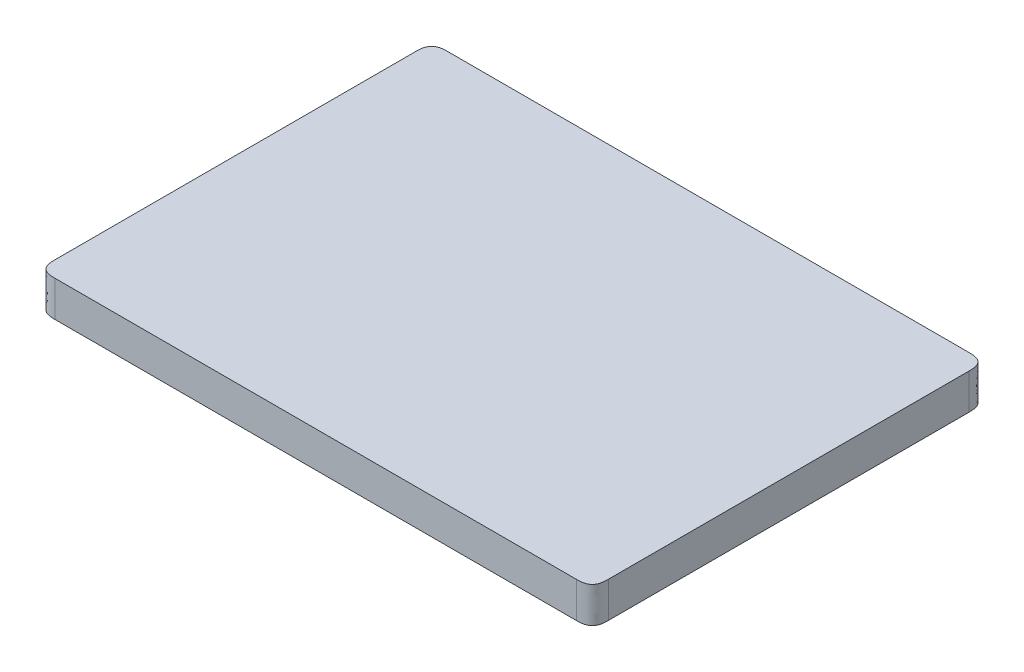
ISO-10303-21;
HEADER;
FILE_DESCRIPTION(('STEP AP214'),'2;1');
FILE_NAME('part.step','',(''),(''),'','','');
FILE_SCHEMA(('AUTOMOTIVE_DESIGN { 1 0 10303 214 1 1 1 1 }'));
ENDSEC;
DATA;
#1=APPLICATION_CONTEXT('core data for automotive mechanical design processes');
#2=APPLICATION_PROTOCOL_DEFINITION('international standard','automotive_design',2000,#1);
#3=PRODUCT_CONTEXT('',#1,'mechanical');
#4=PRODUCT('Part','Part','',(#3));
#5=PRODUCT_RELATED_PRODUCT_CATEGORY('part','',(#4));
#6=PRODUCT_DEFINITION_FORMATION('','',#4);
#7=PRODUCT_DEFINITION_CONTEXT('part definition',#1,'design');
#8=PRODUCT_DEFINITION('design','',#6,#7);
#9=PRODUCT_DEFINITION_SHAPE('','',#8);
#10=(LENGTH_UNIT() NAMED_UNIT(*) SI_UNIT(.MILLI.,.METRE.));
#11=(NAMED_UNIT(*) PLANE_ANGLE_UNIT() SI_UNIT($,.RADIAN.));
#12=(NAMED_UNIT(*) SI_UNIT($,.STERADIAN.) SOLID_ANGLE_UNIT());
#13=UNCERTAINTY_MEASURE_WITH_UNIT(LENGTH_MEASURE(1.E-05),#10,'distance_accuracy_value','');
#14=(GEOMETRIC_REPRESENTATION_CONTEXT(3) GLOBAL_UNCERTAINTY_ASSIGNED_CONTEXT((#13)) GLOBAL_UNIT_ASSIGNED_CONTEXT((#10,
#11,#12)) REPRESENTATION_CONTEXT('',''));
#15=CARTESIAN_POINT('',(0.,0.,0.));
#16=DIRECTION('',(0.,0.,1.));
#17=DIRECTION('',(1.,0.,0.));
#18=AXIS2_PLACEMENT_3D('',#15,#16,#17);
#19=CARTESIAN_POINT('',(155.,20.,110.));
#20=DIRECTION('',(-1.,0.,0.));
#21=DIRECTION('',(0.,0.,1.));
#22=AXIS2_PLACEMENT_3D('',#19,#20,#21);
#23=PLANE('',#22);
#24=DIRECTION('',(0.,0.,-1.));
#25=VECTOR('',#24,1.);
#26=CARTESIAN_POINT('',(155.,0.,110.));
#27=LINE('',#26,#25);
#28=CARTESIAN_POINT('',(155.,0.,101.));
#29=VERTEX_POINT('',#28);
#30=CARTESIAN_POINT('',(155.,0.,-101.));
#31=VERTEX_POINT('',#30);
#32=EDGE_CURVE('E150',#29,#31,#27,.T.);
#33=ORIENTED_EDGE('',*,*,#32,.T.);
#34=CARTESIAN_POINT('',(155.,21.,-101.));
#35=CARTESIAN_POINT('',(155.,13.6666666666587,-101.));
#36=CARTESIAN_POINT('',(155.,6.33333333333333,-101.));
#37=CARTESIAN_POINT('',(155.,-1.,-101.));
#38=B_SPLINE_CURVE_WITH_KNOTS('',3,(#34,#35,#36,#37),.UNSPECIFIED.,.F.,.F.,(4,4),(-0.001,0.021),.UNSPECIFIED.);
#39=CARTESIAN_POINT('',(155.,20.,-101.));
#40=VERTEX_POINT('',#39);
#41=EDGE_CURVE('E323',#31,#40,#38,.F.);
#42=ORIENTED_EDGE('',*,*,#41,.T.);
#43=DIRECTION('',(0.,0.,-1.));
#44=VECTOR('',#43,1.);
#45=CARTESIAN_POINT('',(155.,20.,110.));
#46=LINE('',#45,#44);
#47=CARTESIAN_POINT('',(155.,20.,101.));
#48=VERTEX_POINT('',#47);
#49=EDGE_CURVE('E148',#48,#40,#46,.T.);
#50=ORIENTED_EDGE('',*,*,#49,.F.);
#51=CARTESIAN_POINT('',(155.,-1.,101.));
#52=CARTESIAN_POINT('',(155.,6.33333333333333,101.));
#53=CARTESIAN_POINT('',(155.,13.6666666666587,101.));
#54=CARTESIAN_POINT('',(155.,21.,101.));
#55=B_SPLINE_CURVE_WITH_KNOTS('',3,(#51,#52,#53,#54),.UNSPECIFIED.,.F.,.F.,(4,4),(-0.001,0.021),.UNSPECIFIED.);
#56=EDGE_CURVE('E272',#48,#29,#55,.F.);
#57=ORIENTED_EDGE('',*,*,#56,.T.);
#58=EDGE_LOOP('',(#33,#42,#50,#57));
#59=FACE_BOUND('',#58,.T.);
#60=ADVANCED_FACE('F39',(#59),#23,.F.);
#61=CARTESIAN_POINT('',(-155.,20.,-110.));
#62=DIRECTION('',(0.,0.,1.));
#63=DIRECTION('',(1.,0.,0.));
#64=AXIS2_PLACEMENT_3D('',#61,#62,#63);
#65=PLANE('',#64);
#66=DIRECTION('',(-1.,0.,0.));
#67=VECTOR('',#66,1.);
#68=CARTESIAN_POINT('',(-155.,0.,-110.));
#69=LINE('',#68,#67);
#70=CARTESIAN_POINT('',(146.,0.,-110.));
#71=VERTEX_POINT('',#70);
#72=CARTESIAN_POINT('',(-146.,0.,-110.));
#73=VERTEX_POINT('',#72);
#74=EDGE_CURVE('E146',#71,#73,#69,.T.);
#75=ORIENTED_EDGE('',*,*,#74,.T.);
#76=CARTESIAN_POINT('',(-146.,21.,-110.));
#77=CARTESIAN_POINT('',(-146.,13.6666666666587,-110.));
#78=CARTESIAN_POINT('',(-146.,6.33333333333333,-110.));
#79=CARTESIAN_POINT('',(-146.,-1.,-110.));
#80=B_SPLINE_CURVE_WITH_KNOTS('',3,(#76,#77,#78,#79),.UNSPECIFIED.,.F.,.F.,(4,4),(-0.001,0.021),.UNSPECIFIED.);
#81=CARTESIAN_POINT('',(-146.,20.,-110.));
#82=VERTEX_POINT('',#81);
#83=EDGE_CURVE('E119',#73,#82,#80,.F.);
#84=ORIENTED_EDGE('',*,*,#83,.T.);
#85=DIRECTION('',(-1.,0.,0.));
#86=VECTOR('',#85,1.);
#87=CARTESIAN_POINT('',(-155.,20.,-110.));
#88=LINE('',#87,#86);
#89=CARTESIAN_POINT('',(146.,20.,-110.));
#90=VERTEX_POINT('',#89);
#91=EDGE_CURVE('E203',#90,#82,#88,.T.);
#92=ORIENTED_EDGE('',*,*,#91,.F.);
#93=CARTESIAN_POINT('',(146.,-1.,-110.));
#94=CARTESIAN_POINT('',(146.,6.33333333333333,-110.));
#95=CARTESIAN_POINT('',(146.,13.6666666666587,-110.));
#96=CARTESIAN_POINT('',(146.,21.,-110.));
#97=B_SPLINE_CURVE_WITH_KNOTS('',3,(#93,#94,#95,#96),.UNSPECIFIED.,.F.,.F.,(4,4),(-0.001,0.021),.UNSPECIFIED.);
#98=EDGE_CURVE('E126',#90,#71,#97,.F.);
#99=ORIENTED_EDGE('',*,*,#98,.T.);
#100=EDGE_LOOP('',(#75,#84,#92,#99));
#101=FACE_BOUND('',#100,.T.);
#102=ADVANCED_FACE('F288',(#101),#65,.F.);
#103=CARTESIAN_POINT('',(-155.,20.,110.));
#104=DIRECTION('',(1.,0.,0.));
#105=DIRECTION('',(0.,0.,-1.));
#106=AXIS2_PLACEMENT_3D('',#103,#104,#105);
#107=PLANE('',#106);
#108=DIRECTION('',(0.,0.,1.));
#109=VECTOR('',#108,1.);
#110=CARTESIAN_POINT('',(-155.,20.,110.));
#111=LINE('',#110,#109);
#112=CARTESIAN_POINT('',(-155.,20.,-101.));
#113=VERTEX_POINT('',#112);
#114=CARTESIAN_POINT('',(-155.,20.,101.));
#115=VERTEX_POINT('',#114);
#116=EDGE_CURVE('E137',#113,#115,#111,.T.);
#117=ORIENTED_EDGE('',*,*,#116,.F.);
#118=CARTESIAN_POINT('',(-155.,-1.,-101.));
#119=CARTESIAN_POINT('',(-155.,6.33333333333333,-101.));
#120=CARTESIAN_POINT('',(-155.,13.6666666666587,-101.));
#121=CARTESIAN_POINT('',(-155.,21.,-101.));
#122=B_SPLINE_CURVE_WITH_KNOTS('',3,(#118,#119,#120,#121),.UNSPECIFIED.,.F.,.F.,(4,4),(-0.001,
0.021),.UNSPECIFIED.);
#123=CARTESIAN_POINT('',(-155.,0.,-101.));
#124=VERTEX_POINT('',#123);
#125=EDGE_CURVE('E117',#113,#124,#122,.F.);
#126=ORIENTED_EDGE('',*,*,#125,.T.);
#127=DIRECTION('',(0.,0.,1.));
#128=VECTOR('',#127,1.);
#129=CARTESIAN_POINT('',(-155.,0.,110.));
#130=LINE('',#129,#128);
#131=CARTESIAN_POINT('',(-155.,0.,101.));
#132=VERTEX_POINT('',#131);
#133=EDGE_CURVE('E135',#124,#132,#130,.T.);
#134=ORIENTED_EDGE('',*,*,#133,.T.);
#135=CARTESIAN_POINT('',(-155.,21.,101.));
#136=CARTESIAN_POINT('',(-155.,13.6666666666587,101.));
#137=CARTESIAN_POINT('',(-155.,6.33333333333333,101.));
#138=CARTESIAN_POINT('',(-155.,-1.,101.));
#139=B_SPLINE_CURVE_WITH_KNOTS('',3,(#135,#136,#137,#138),.UNSPECIFIED.,.F.,.F.,(4,4),(-0.001,
0.021),.UNSPECIFIED.);
#140=EDGE_CURVE('E139',#132,#115,#139,.F.);
#141=ORIENTED_EDGE('',*,*,#140,.T.);
#142=EDGE_LOOP('',(#117,#126,#134,#141));
#143=FACE_BOUND('',#142,.T.);
#144=ADVANCED_FACE('F134',(#143),#107,.F.);
#145=CARTESIAN_POINT('',(-155.,20.,110.));
#146=DIRECTION('',(0.,0.,-1.));
#147=DIRECTION('',(-1.,0.,0.));
#148=AXIS2_PLACEMENT_3D('',#145,#146,#147);
#149=PLANE('',#148);
#150=DIRECTION('',(1.,0.,0.));
#151=VECTOR('',#150,1.);
#152=CARTESIAN_POINT('',(-155.,0.,110.));
#153=LINE('',#152,#151);
#154=CARTESIAN_POINT('',(-146.,0.,110.));
#155=VERTEX_POINT('',#154);
#156=CARTESIAN_POINT('',(146.,0.,110.));
#157=VERTEX_POINT('',#156);
#158=EDGE_CURVE('E145',#155,#157,#153,.T.);
#159=ORIENTED_EDGE('',*,*,#158,.T.);
#160=CARTESIAN_POINT('',(146.,21.,110.));
#161=CARTESIAN_POINT('',(146.,13.6666666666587,110.));
#162=CARTESIAN_POINT('',(146.,6.33333333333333,110.));
#163=CARTESIAN_POINT('',(146.,-1.,110.));
#164=B_SPLINE_CURVE_WITH_KNOTS('',3,(#160,#161,#162,#163),.UNSPECIFIED.,.F.,.F.,(4,4),(-0.001,
0.021),.UNSPECIFIED.);
#165=CARTESIAN_POINT('',(146.,20.,110.));
#166=VERTEX_POINT('',#165);
#167=EDGE_CURVE('E11',#157,#166,#164,.F.);
#168=ORIENTED_EDGE('',*,*,#167,.T.);
#169=DIRECTION('',(1.,0.,0.));
#170=VECTOR('',#169,1.);
#171=CARTESIAN_POINT('',(-155.,20.,110.));
#172=LINE('',#171,#170);
#173=CARTESIAN_POINT('',(-146.,20.,110.));
#174=VERTEX_POINT('',#173);
#175=EDGE_CURVE('E220',#174,#166,#172,.T.);
#176=ORIENTED_EDGE('',*,*,#175,.F.);
#177=CARTESIAN_POINT('',(-146.,-1.,110.));
#178=CARTESIAN_POINT('',(-146.,6.33333333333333,110.));
#179=CARTESIAN_POINT('',(-146.,13.6666666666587,110.));
#180=CARTESIAN_POINT('',(-146.,21.,110.));
#181=B_SPLINE_CURVE_WITH_KNOTS('',3,(#177,#178,#179,#180),.UNSPECIFIED.,.F.,.F.,(4,4),(-0.001,
0.021),.UNSPECIFIED.);
#182=EDGE_CURVE('E53',#174,#155,#181,.F.);
#183=ORIENTED_EDGE('',*,*,#182,.T.);
#184=EDGE_LOOP('',(#159,#168,#176,#183));
#185=FACE_BOUND('',#184,.T.);
#186=ADVANCED_FACE('F182',(#185),#149,.F.);
#187=CARTESIAN_POINT('',(0.,20.,0.));
#188=DIRECTION('',(0.,-1.,0.));
#189=DIRECTION('',(0.,0.,-1.));
#190=AXIS2_PLACEMENT_3D('',#187,#188,#189);
#191=PLANE('',#190);
#192=ORIENTED_EDGE('',*,*,#91,.T.);
#193=CARTESIAN_POINT('',(-155.,20.,-101.));
#194=CARTESIAN_POINT('',(-155.,20.,-102.513782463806));
#195=CARTESIAN_POINT('',(-155.,20.,-104.027564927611));
#196=CARTESIAN_POINT('',(-154.354772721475,20.,-107.363961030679));
#197=CARTESIAN_POINT('',(-152.363961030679,20.,-109.354772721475));
#198=CARTESIAN_POINT('',(-149.027564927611,20.,-110.));
#199=CARTESIAN_POINT('',(-147.513782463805,20.,-110.));
#200=CARTESIAN_POINT('',(-146.,20.,-110.));
#201=B_SPLINE_CURVE_WITH_KNOTS('',5,(#193,#194,#195,#196,#197,#198,#199,#200),.UNSPECIFIED.,.F.,
.F.,(6,2,6),(0.,0.5,1.),.UNSPECIFIED.);
#202=EDGE_CURVE('E258',#82,#113,#201,.F.);
#203=ORIENTED_EDGE('',*,*,#202,.T.);
#204=ORIENTED_EDGE('',*,*,#116,.T.);
#205=CARTESIAN_POINT('',(-146.,20.,110.));
#206=CARTESIAN_POINT('',(-147.513782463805,20.,110.));
#207=CARTESIAN_POINT('',(-149.027564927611,20.,110.));
#208=CARTESIAN_POINT('',(-152.363961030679,20.,109.354772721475));
#209=CARTESIAN_POINT('',(-154.354772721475,20.,107.363961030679));
#210=CARTESIAN_POINT('',(-155.,20.,104.027564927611));
#211=CARTESIAN_POINT('',(-155.,20.,102.513782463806));
#212=CARTESIAN_POINT('',(-155.,20.,101.));
#213=B_SPLINE_CURVE_WITH_KNOTS('',5,(#205,#206,#207,#208,#209,#210,#211,#212),.UNSPECIFIED.,.F.,
.F.,(6,2,6),(0.,0.5,1.),.UNSPECIFIED.);
#214=EDGE_CURVE('E66',#115,#174,#213,.F.);
#215=ORIENTED_EDGE('',*,*,#214,.T.);
#216=ORIENTED_EDGE('',*,*,#175,.T.);
#217=CARTESIAN_POINT('',(155.,20.,101.));
#218=CARTESIAN_POINT('',(155.,20.,102.513782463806));
#219=CARTESIAN_POINT('',(155.,20.,104.027564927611));
#220=CARTESIAN_POINT('',(154.354772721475,20.,107.363961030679));
#221=CARTESIAN_POINT('',(152.363961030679,20.,109.354772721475));
#222=CARTESIAN_POINT('',(149.027564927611,20.,110.));
#223=CARTESIAN_POINT('',(147.513782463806,20.,110.));
#224=CARTESIAN_POINT('',(146.,20.,110.));
#225=B_SPLINE_CURVE_WITH_KNOTS('',5,(#217,#218,#219,#220,#221,#222,#223,#224),.UNSPECIFIED.,.F.,
.F.,(6,2,6),(0.,0.5,1.),.UNSPECIFIED.);
#226=EDGE_CURVE('E235',#166,#48,#225,.F.);
#227=ORIENTED_EDGE('',*,*,#226,.T.);
#228=ORIENTED_EDGE('',*,*,#49,.T.);
#229=CARTESIAN_POINT('',(146.,20.,-110.));
#230=CARTESIAN_POINT('',(147.513782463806,20.,-110.));
#231=CARTESIAN_POINT('',(149.027564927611,20.,-110.));
#232=CARTESIAN_POINT('',(152.363961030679,20.,-109.354772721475));
#233=CARTESIAN_POINT('',(154.354772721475,20.,-107.363961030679));
#234=CARTESIAN_POINT('',(155.,20.,-104.027564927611));
#235=CARTESIAN_POINT('',(155.,20.,-102.513782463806));
#236=CARTESIAN_POINT('',(155.,20.,-101.));
#237=B_SPLINE_CURVE_WITH_KNOTS('',5,(#229,#230,#231,#232,#233,#234,#235,#236),.UNSPECIFIED.,.F.,
.F.,(6,2,6),(0.,0.5,1.),.UNSPECIFIED.);
#238=EDGE_CURVE('E247',#40,#90,#237,.F.);
#239=ORIENTED_EDGE('',*,*,#238,.T.);
#240=EDGE_LOOP('',(#192,#203,#204,#215,#216,#227,#228,#239));
#241=FACE_BOUND('',#240,.T.);
#242=ADVANCED_FACE('F180',(#241),#191,.F.);
#243=CARTESIAN_POINT('',(0.,0.,0.));
#244=DIRECTION('',(0.,-1.,0.));
#245=DIRECTION('',(0.,0.,-1.));
#246=AXIS2_PLACEMENT_3D('',#243,#244,#245);
#247=PLANE('',#246);
#248=ORIENTED_EDGE('',*,*,#133,.F.);
#249=CARTESIAN_POINT('',(-146.,0.,-110.));
#250=CARTESIAN_POINT('',(-147.513782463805,0.,-110.));
#251=CARTESIAN_POINT('',(-149.027564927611,0.,-110.));
#252=CARTESIAN_POINT('',(-152.363961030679,0.,-109.354772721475));
#253=CARTESIAN_POINT('',(-154.354772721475,0.,-107.363961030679));
#254=CARTESIAN_POINT('',(-155.,0.,-104.027564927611));
#255=CARTESIAN_POINT('',(-155.,0.,-102.513782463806));
#256=CARTESIAN_POINT('',(-155.,0.,-101.));
#257=B_SPLINE_CURVE_WITH_KNOTS('',5,(#249,#250,#251,#252,#253,#254,#255,#256),.UNSPECIFIED.,.F.,
.F.,(6,2,6),(0.,0.5,1.),.UNSPECIFIED.);
#258=EDGE_CURVE('E112',#124,#73,#257,.F.);
#259=ORIENTED_EDGE('',*,*,#258,.T.);
#260=ORIENTED_EDGE('',*,*,#74,.F.);
#261=CARTESIAN_POINT('',(155.,0.,-101.));
#262=CARTESIAN_POINT('',(155.,0.,-102.513782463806));
#263=CARTESIAN_POINT('',(155.,0.,-104.027564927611));
#264=CARTESIAN_POINT('',(154.354772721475,0.,-107.363961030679));
#265=CARTESIAN_POINT('',(152.363961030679,0.,-109.354772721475));
#266=CARTESIAN_POINT('',(149.027564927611,0.,-110.));
#267=CARTESIAN_POINT('',(147.513782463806,0.,-110.));
#268=CARTESIAN_POINT('',(146.,0.,-110.));
#269=B_SPLINE_CURVE_WITH_KNOTS('',5,(#261,#262,#263,#264,#265,#266,#267,#268),.UNSPECIFIED.,.F.,
.F.,(6,2,6),(0.,0.5,1.),.UNSPECIFIED.);
#270=EDGE_CURVE('E127',#71,#31,#269,.F.);
#271=ORIENTED_EDGE('',*,*,#270,.T.);
#272=ORIENTED_EDGE('',*,*,#32,.F.);
#273=CARTESIAN_POINT('',(146.,0.,110.));
#274=CARTESIAN_POINT('',(147.513782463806,0.,110.));
#275=CARTESIAN_POINT('',(149.027564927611,0.,110.));
#276=CARTESIAN_POINT('',(152.363961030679,0.,109.354772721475));
#277=CARTESIAN_POINT('',(154.354772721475,0.,107.363961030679));
#278=CARTESIAN_POINT('',(155.,0.,104.027564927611));
#279=CARTESIAN_POINT('',(155.,0.,102.513782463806));
#280=CARTESIAN_POINT('',(155.,0.,101.));
#281=B_SPLINE_CURVE_WITH_KNOTS('',5,(#273,#274,#275,#276,#277,#278,#279,#280),.UNSPECIFIED.,.F.,
.F.,(6,2,6),(0.,0.5,1.),.UNSPECIFIED.);
#282=EDGE_CURVE('E324',#29,#157,#281,.F.);
#283=ORIENTED_EDGE('',*,*,#282,.T.);
#284=ORIENTED_EDGE('',*,*,#158,.F.);
#285=CARTESIAN_POINT('',(-155.,0.,101.));
#286=CARTESIAN_POINT('',(-155.,0.,102.513782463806));
#287=CARTESIAN_POINT('',(-155.,0.,104.027564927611));
#288=CARTESIAN_POINT('',(-154.354772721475,0.,107.363961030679));
#289=CARTESIAN_POINT('',(-152.363961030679,0.,109.354772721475));
#290=CARTESIAN_POINT('',(-149.027564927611,0.,110.));
#291=CARTESIAN_POINT('',(-147.513782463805,0.,110.));
#292=CARTESIAN_POINT('',(-146.,0.,110.));
#293=B_SPLINE_CURVE_WITH_KNOTS('',5,(#285,#286,#287,#288,#289,#290,#291,#292),.UNSPECIFIED.,.F.,
.F.,(6,2,6),(0.,0.5,1.),.UNSPECIFIED.);
#294=EDGE_CURVE('E138',#155,#132,#293,.F.);
#295=ORIENTED_EDGE('',*,*,#294,.T.);
#296=EDGE_LOOP('',(#248,#259,#260,#271,#272,#283,#284,#295));
#297=FACE_BOUND('',#296,.T.);
#298=ADVANCED_FACE('F142',(#297),#247,.T.);
#299=CARTESIAN_POINT('',(-155.,21.,-101.));
#300=CARTESIAN_POINT('',(-155.,13.6666666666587,-101.));
#301=CARTESIAN_POINT('',(-155.,6.33333333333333,-101.));
#302=CARTESIAN_POINT('',(-155.,-1.,-101.));
#303=CARTESIAN_POINT('',(-155.,21.,-102.513782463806));
#304=CARTESIAN_POINT('',(-155.,13.6666666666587,-102.513782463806));
#305=CARTESIAN_POINT('',(-155.,6.33333333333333,-102.513782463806));
#306=CARTESIAN_POINT('',(-155.,-1.,-102.513782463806));
#307=CARTESIAN_POINT('',(-155.,21.,-104.027564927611));
#308=CARTESIAN_POINT('',(-155.,13.6666666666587,-104.027564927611));
#309=CARTESIAN_POINT('',(-155.,6.33333333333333,-104.027564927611));
#310=CARTESIAN_POINT('',(-155.,-1.,-104.027564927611));
#311=CARTESIAN_POINT('',(-154.354772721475,21.,-107.363961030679));
#312=CARTESIAN_POINT('',(-154.354772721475,13.6666666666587,-107.363961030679));
#313=CARTESIAN_POINT('',(-154.354772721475,6.33333333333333,-107.363961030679));
#314=CARTESIAN_POINT('',(-154.354772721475,-1.,-107.363961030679));
#315=CARTESIAN_POINT('',(-152.363961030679,21.,-109.354772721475));
#316=CARTESIAN_POINT('',(-152.363961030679,13.6666666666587,-109.354772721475));
#317=CARTESIAN_POINT('',(-152.363961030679,6.33333333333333,-109.354772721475));
#318=CARTESIAN_POINT('',(-152.363961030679,-1.,-109.354772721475));
#319=CARTESIAN_POINT('',(-149.027564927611,21.,-110.));
#320=CARTESIAN_POINT('',(-149.027564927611,13.6666666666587,-110.));
#321=CARTESIAN_POINT('',(-149.027564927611,6.33333333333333,-110.));
#322=CARTESIAN_POINT('',(-149.027564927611,-1.,-110.));
#323=CARTESIAN_POINT('',(-147.513782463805,21.,-110.));
#324=CARTESIAN_POINT('',(-147.513782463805,13.6666666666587,-110.));
#325=CARTESIAN_POINT('',(-147.513782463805,6.33333333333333,-110.));
#326=CARTESIAN_POINT('',(-147.513782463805,-1.,-110.));
#327=CARTESIAN_POINT('',(-146.,21.,-110.));
#328=CARTESIAN_POINT('',(-146.,13.6666666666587,-110.));
#329=CARTESIAN_POINT('',(-146.,6.33333333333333,-110.));
#330=CARTESIAN_POINT('',(-146.,-1.,-110.));
#331=B_SPLINE_SURFACE_WITH_KNOTS('',5,3,((#299,#300,#301,#302),(#303,#304,#305,#306),(#307,#308,
#309,#310),(#311,#312,#313,#314),(#315,#316,#317,#318),(#319,#320,#321,#322),(#323,#324,#325,
#326),(#327,#328,#329,#330)),.UNSPECIFIED.,.F.,.F.,.F.,(6,2,6),(4,4),(0.,0.5,1.),(-0.001,0.021),.UNSPECIFIED.);
#332=ORIENTED_EDGE('',*,*,#202,.F.);
#333=ORIENTED_EDGE('',*,*,#83,.F.);
#334=ORIENTED_EDGE('',*,*,#258,.F.);
#335=ORIENTED_EDGE('',*,*,#125,.F.);
#336=EDGE_LOOP('',(#332,#333,#334,#335));
#337=FACE_BOUND('',#336,.T.);
#338=ADVANCED_FACE('F116',(#337),#331,.T.);
#339=CARTESIAN_POINT('',(146.,21.,-110.));
#340=CARTESIAN_POINT('',(146.,13.6666666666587,-110.));
#341=CARTESIAN_POINT('',(146.,6.33333333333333,-110.));
#342=CARTESIAN_POINT('',(146.,-1.,-110.));
#343=CARTESIAN_POINT('',(147.513782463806,21.,-110.));
#344=CARTESIAN_POINT('',(147.513782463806,13.6666666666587,-110.));
#345=CARTESIAN_POINT('',(147.513782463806,6.33333333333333,-110.));
#346=CARTESIAN_POINT('',(147.513782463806,-1.,-110.));
#347=CARTESIAN_POINT('',(149.027564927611,21.,-110.));
#348=CARTESIAN_POINT('',(149.027564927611,13.6666666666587,-110.));
#349=CARTESIAN_POINT('',(149.027564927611,6.33333333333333,-110.));
#350=CARTESIAN_POINT('',(149.027564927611,-1.,-110.));
#351=CARTESIAN_POINT('',(152.363961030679,21.,-109.354772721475));
#352=CARTESIAN_POINT('',(152.363961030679,13.6666666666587,-109.354772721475));
#353=CARTESIAN_POINT('',(152.363961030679,6.33333333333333,-109.354772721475));
#354=CARTESIAN_POINT('',(152.363961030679,-1.,-109.354772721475));
#355=CARTESIAN_POINT('',(154.354772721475,21.,-107.363961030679));
#356=CARTESIAN_POINT('',(154.354772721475,13.6666666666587,-107.363961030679));
#357=CARTESIAN_POINT('',(154.354772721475,6.33333333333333,-107.363961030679));
#358=CARTESIAN_POINT('',(154.354772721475,-1.,-107.363961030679));
#359=CARTESIAN_POINT('',(155.,21.,-104.027564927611));
#360=CARTESIAN_POINT('',(155.,13.6666666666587,-104.027564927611));
#361=CARTESIAN_POINT('',(155.,6.33333333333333,-104.027564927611));
#362=CARTESIAN_POINT('',(155.,-1.,-104.027564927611));
#363=CARTESIAN_POINT('',(155.,21.,-102.513782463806));
#364=CARTESIAN_POINT('',(155.,13.6666666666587,-102.513782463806));
#365=CARTESIAN_POINT('',(155.,6.33333333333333,-102.513782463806));
#366=CARTESIAN_POINT('',(155.,-1.,-102.513782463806));
#367=CARTESIAN_POINT('',(155.,21.,-101.));
#368=CARTESIAN_POINT('',(155.,13.6666666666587,-101.));
#369=CARTESIAN_POINT('',(155.,6.33333333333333,-101.));
#370=CARTESIAN_POINT('',(155.,-1.,-101.));
#371=B_SPLINE_SURFACE_WITH_KNOTS('',5,3,((#339,#340,#341,#342),(#343,#344,#345,#346),(#347,#348,
#349,#350),(#351,#352,#353,#354),(#355,#356,#357,#358),(#359,#360,#361,#362),(#363,#364,#365,
#366),(#367,#368,#369,#370)),.UNSPECIFIED.,.F.,.F.,.F.,(6,2,6),(4,4),(0.,0.5,1.),(-0.001,0.021),.UNSPECIFIED.);
#372=ORIENTED_EDGE('',*,*,#238,.F.);
#373=ORIENTED_EDGE('',*,*,#41,.F.);
#374=ORIENTED_EDGE('',*,*,#270,.F.);
#375=ORIENTED_EDGE('',*,*,#98,.F.);
#376=EDGE_LOOP('',(#372,#373,#374,#375));
#377=FACE_BOUND('',#376,.T.);
#378=ADVANCED_FACE('F332',(#377),#371,.T.);
#379=CARTESIAN_POINT('',(155.,21.,101.));
#380=CARTESIAN_POINT('',(155.,13.6666666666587,101.));
#381=CARTESIAN_POINT('',(155.,6.33333333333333,101.));
#382=CARTESIAN_POINT('',(155.,-1.,101.));
#383=CARTESIAN_POINT('',(155.,21.,102.513782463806));
#384=CARTESIAN_POINT('',(155.,13.6666666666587,102.513782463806));
#385=CARTESIAN_POINT('',(155.,6.33333333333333,102.513782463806));
#386=CARTESIAN_POINT('',(155.,-1.,102.513782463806));
#387=CARTESIAN_POINT('',(155.,21.,104.027564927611));
#388=CARTESIAN_POINT('',(155.,13.6666666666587,104.027564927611));
#389=CARTESIAN_POINT('',(155.,6.33333333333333,104.027564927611));
#390=CARTESIAN_POINT('',(155.,-1.,104.027564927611));
#391=CARTESIAN_POINT('',(154.354772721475,21.,107.363961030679));
#392=CARTESIAN_POINT('',(154.354772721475,13.6666666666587,107.363961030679));
#393=CARTESIAN_POINT('',(154.354772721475,6.33333333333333,107.363961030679));
#394=CARTESIAN_POINT('',(154.354772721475,-1.,107.363961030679));
#395=CARTESIAN_POINT('',(152.363961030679,21.,109.354772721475));
#396=CARTESIAN_POINT('',(152.363961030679,13.6666666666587,109.354772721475));
#397=CARTESIAN_POINT('',(152.363961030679,6.33333333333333,109.354772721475));
#398=CARTESIAN_POINT('',(152.363961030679,-1.,109.354772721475));
#399=CARTESIAN_POINT('',(149.027564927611,21.,110.));
#400=CARTESIAN_POINT('',(149.027564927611,13.6666666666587,110.));
#401=CARTESIAN_POINT('',(149.027564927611,6.33333333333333,110.));
#402=CARTESIAN_POINT('',(149.027564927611,-1.,110.));
#403=CARTESIAN_POINT('',(147.513782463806,21.,110.));
#404=CARTESIAN_POINT('',(147.513782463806,13.6666666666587,110.));
#405=CARTESIAN_POINT('',(147.513782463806,6.33333333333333,110.));
#406=CARTESIAN_POINT('',(147.513782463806,-1.,110.));
#407=CARTESIAN_POINT('',(146.,21.,110.));
#408=CARTESIAN_POINT('',(146.,13.6666666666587,110.));
#409=CARTESIAN_POINT('',(146.,6.33333333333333,110.));
#410=CARTESIAN_POINT('',(146.,-1.,110.));
#411=B_SPLINE_SURFACE_WITH_KNOTS('',5,3,((#379,#380,#381,#382),(#383,#384,#385,#386),(#387,#388,
#389,#390),(#391,#392,#393,#394),(#395,#396,#397,#398),(#399,#400,#401,#402),(#403,#404,#405,
#406),(#407,#408,#409,#410)),.UNSPECIFIED.,.F.,.F.,.F.,(6,2,6),(4,4),(0.,0.5,1.),(-0.001,0.021),.UNSPECIFIED.);
#412=ORIENTED_EDGE('',*,*,#226,.F.);
#413=ORIENTED_EDGE('',*,*,#167,.F.);
#414=ORIENTED_EDGE('',*,*,#282,.F.);
#415=ORIENTED_EDGE('',*,*,#56,.F.);
#416=EDGE_LOOP('',(#412,#413,#414,#415));
#417=FACE_BOUND('',#416,.T.);
#418=ADVANCED_FACE('F354',(#417),#411,.T.);
#419=CARTESIAN_POINT('',(-146.,21.,110.));
#420=CARTESIAN_POINT('',(-146.,13.6666666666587,110.));
#421=CARTESIAN_POINT('',(-146.,6.33333333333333,110.));
#422=CARTESIAN_POINT('',(-146.,-1.,110.));
#423=CARTESIAN_POINT('',(-147.513782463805,21.,110.));
#424=CARTESIAN_POINT('',(-147.513782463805,13.6666666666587,110.));
#425=CARTESIAN_POINT('',(-147.513782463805,6.33333333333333,110.));
#426=CARTESIAN_POINT('',(-147.513782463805,-1.,110.));
#427=CARTESIAN_POINT('',(-149.027564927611,21.,110.));
#428=CARTESIAN_POINT('',(-149.027564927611,13.6666666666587,110.));
#429=CARTESIAN_POINT('',(-149.027564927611,6.33333333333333,110.));
#430=CARTESIAN_POINT('',(-149.027564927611,-1.,110.));
#431=CARTESIAN_POINT('',(-152.363961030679,21.,109.354772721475));
#432=CARTESIAN_POINT('',(-152.363961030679,13.6666666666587,109.354772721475));
#433=CARTESIAN_POINT('',(-152.363961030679,6.33333333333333,109.354772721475));
#434=CARTESIAN_POINT('',(-152.363961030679,-1.,109.354772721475));
#435=CARTESIAN_POINT('',(-154.354772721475,21.,107.363961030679));
#436=CARTESIAN_POINT('',(-154.354772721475,13.6666666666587,107.363961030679));
#437=CARTESIAN_POINT('',(-154.354772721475,6.33333333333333,107.363961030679));
#438=CARTESIAN_POINT('',(-154.354772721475,-1.,107.363961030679));
#439=CARTESIAN_POINT('',(-155.,21.,104.027564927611));
#440=CARTESIAN_POINT('',(-155.,13.6666666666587,104.027564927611));
#441=CARTESIAN_POINT('',(-155.,6.33333333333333,104.027564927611));
#442=CARTESIAN_POINT('',(-155.,-1.,104.027564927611));
#443=CARTESIAN_POINT('',(-155.,21.,102.513782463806));
#444=CARTESIAN_POINT('',(-155.,13.6666666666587,102.513782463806));
#445=CARTESIAN_POINT('',(-155.,6.33333333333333,102.513782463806));
#446=CARTESIAN_POINT('',(-155.,-1.,102.513782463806));
#447=CARTESIAN_POINT('',(-155.,21.,101.));
#448=CARTESIAN_POINT('',(-155.,13.6666666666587,101.));
#449=CARTESIAN_POINT('',(-155.,6.33333333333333,101.));
#450=CARTESIAN_POINT('',(-155.,-1.,101.));
#451=B_SPLINE_SURFACE_WITH_KNOTS('',5,3,((#419,#420,#421,#422),(#423,#424,#425,#426),(#427,#428,
#429,#430),(#431,#432,#433,#434),(#435,#436,#437,#438),(#439,#440,#441,#442),(#443,#444,#445,
#446),(#447,#448,#449,#450)),.UNSPECIFIED.,.F.,.F.,.F.,(6,2,6),(4,4),(0.,0.5,1.),(-0.001,0.021),.UNSPECIFIED.);
#452=ORIENTED_EDGE('',*,*,#214,.F.);
#453=ORIENTED_EDGE('',*,*,#140,.F.);
#454=ORIENTED_EDGE('',*,*,#294,.F.);
#455=ORIENTED_EDGE('',*,*,#182,.F.);
#456=EDGE_LOOP('',(#452,#453,#454,#455));
#457=FACE_BOUND('',#456,.T.);
#458=ADVANCED_FACE('F42',(#457),#451,.T.);
#459=CLOSED_SHELL('',(#60,#102,#144,#186,#242,#298,#338,#378,#418,#458));
#460=MANIFOLD_SOLID_BREP('B2',#459);
#461=ADVANCED_BREP_SHAPE_REPRESENTATION('',(#18,#460),#14);
#462=SHAPE_DEFINITION_REPRESENTATION(#9,#461);
ENDSEC;
END-ISO-10303-21;
